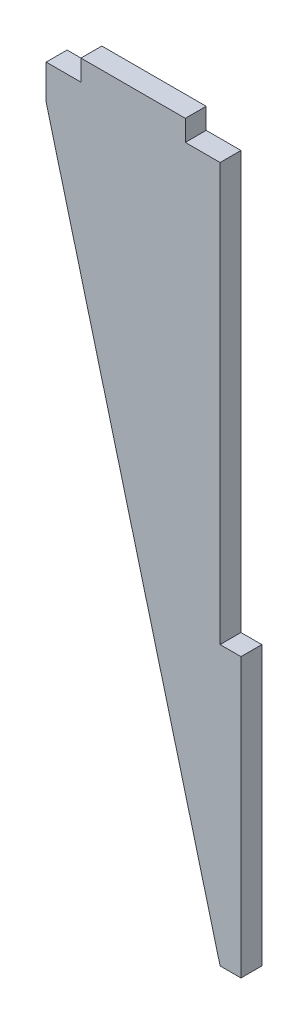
ISO-10303-21;
HEADER;
FILE_DESCRIPTION(('STEP AP214'),'2;1');
FILE_NAME('part.step','',(''),(''),'','','');
FILE_SCHEMA(('AUTOMOTIVE_DESIGN { 1 0 10303 214 1 1 1 1 }'));
ENDSEC;
DATA;
#1=APPLICATION_CONTEXT('core data for automotive mechanical design processes');
#2=APPLICATION_PROTOCOL_DEFINITION('international standard','automotive_design',2000,#1);
#3=PRODUCT_CONTEXT('',#1,'mechanical');
#4=PRODUCT('Part','Part','',(#3));
#5=PRODUCT_RELATED_PRODUCT_CATEGORY('part','',(#4));
#6=PRODUCT_DEFINITION_FORMATION('','',#4);
#7=PRODUCT_DEFINITION_CONTEXT('part definition',#1,'design');
#8=PRODUCT_DEFINITION('design','',#6,#7);
#9=PRODUCT_DEFINITION_SHAPE('','',#8);
#10=(LENGTH_UNIT() NAMED_UNIT(*) SI_UNIT(.MILLI.,.METRE.));
#11=(NAMED_UNIT(*) PLANE_ANGLE_UNIT() SI_UNIT($,.RADIAN.));
#12=(NAMED_UNIT(*) SI_UNIT($,.STERADIAN.) SOLID_ANGLE_UNIT());
#13=UNCERTAINTY_MEASURE_WITH_UNIT(LENGTH_MEASURE(1.E-05),#10,'distance_accuracy_value','');
#14=(GEOMETRIC_REPRESENTATION_CONTEXT(3) GLOBAL_UNCERTAINTY_ASSIGNED_CONTEXT((#13)) GLOBAL_UNIT_ASSIGNED_CONTEXT((#10,
#11,#12)) REPRESENTATION_CONTEXT('',''));
#15=CARTESIAN_POINT('',(0.,0.,0.));
#16=DIRECTION('',(0.,0.,1.));
#17=DIRECTION('',(1.,0.,0.));
#18=AXIS2_PLACEMENT_3D('',#15,#16,#17);
#19=CARTESIAN_POINT('',(-95.0000000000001,-5.,109.737996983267));
#20=DIRECTION('',(0.967074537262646,0.254493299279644,0.));
#21=DIRECTION('',(-0.254493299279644,0.967074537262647,0.));
#22=AXIS2_PLACEMENT_3D('',#19,#20,#21);
#23=PLANE('',#22);
#24=DIRECTION('',(0.254493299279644,-0.967074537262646,0.));
#25=VECTOR('',#24,1.);
#26=CARTESIAN_POINT('',(-95.0000000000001,-5.,3.));
#27=LINE('',#26,#25);
#28=CARTESIAN_POINT('',(-95.0000000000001,-5.,3.));
#29=VERTEX_POINT('',#28);
#30=CARTESIAN_POINT('',(-70.,-100.,3.));
#31=VERTEX_POINT('',#30);
#32=EDGE_CURVE('E159',#29,#31,#27,.T.);
#33=ORIENTED_EDGE('',*,*,#32,.F.);
#34=DIRECTION('',(0.,0.,-1.));
#35=VECTOR('',#34,1.);
#36=CARTESIAN_POINT('',(-95.0000000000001,-5.,109.737996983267));
#37=LINE('',#36,#35);
#38=CARTESIAN_POINT('',(-95.0000000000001,-5.,0.));
#39=VERTEX_POINT('',#38);
#40=EDGE_CURVE('E37',#29,#39,#37,.T.);
#41=ORIENTED_EDGE('',*,*,#40,.T.);
#42=DIRECTION('',(0.254493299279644,-0.967074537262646,0.));
#43=VECTOR('',#42,1.);
#44=CARTESIAN_POINT('',(-95.0000000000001,-5.,0.));
#45=LINE('',#44,#43);
#46=CARTESIAN_POINT('',(-70.,-100.,0.));
#47=VERTEX_POINT('',#46);
#48=EDGE_CURVE('E167',#39,#47,#45,.T.);
#49=ORIENTED_EDGE('',*,*,#48,.T.);
#50=DIRECTION('',(0.,0.,-1.));
#51=VECTOR('',#50,1.);
#52=CARTESIAN_POINT('',(-70.,-100.,109.737996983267));
#53=LINE('',#52,#51);
#54=EDGE_CURVE('E100',#31,#47,#53,.T.);
#55=ORIENTED_EDGE('',*,*,#54,.F.);
#56=EDGE_LOOP('',(#33,#41,#49,#55));
#57=FACE_BOUND('',#56,.T.);
#58=ADVANCED_FACE('F33',(#57),#23,.F.);
#59=CARTESIAN_POINT('',(-67.,-100.,109.737996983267));
#60=DIRECTION('',(0.,1.,0.));
#61=DIRECTION('',(0.,0.,1.));
#62=AXIS2_PLACEMENT_3D('',#59,#60,#61);
#63=PLANE('',#62);
#64=DIRECTION('',(1.,0.,0.));
#65=VECTOR('',#64,1.);
#66=CARTESIAN_POINT('',(-67.,-100.,3.));
#67=LINE('',#66,#65);
#68=CARTESIAN_POINT('',(-67.,-100.,3.));
#69=VERTEX_POINT('',#68);
#70=EDGE_CURVE('E107',#31,#69,#67,.T.);
#71=ORIENTED_EDGE('',*,*,#70,.F.);
#72=ORIENTED_EDGE('',*,*,#54,.T.);
#73=DIRECTION('',(1.,0.,0.));
#74=VECTOR('',#73,1.);
#75=CARTESIAN_POINT('',(-67.,-100.,0.));
#76=LINE('',#75,#74);
#77=CARTESIAN_POINT('',(-67.,-100.,0.));
#78=VERTEX_POINT('',#77);
#79=EDGE_CURVE('E166',#47,#78,#76,.T.);
#80=ORIENTED_EDGE('',*,*,#79,.T.);
#81=DIRECTION('',(0.,0.,-1.));
#82=VECTOR('',#81,1.);
#83=CARTESIAN_POINT('',(-67.,-100.,109.737996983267));
#84=LINE('',#83,#82);
#85=EDGE_CURVE('E168',#69,#78,#84,.T.);
#86=ORIENTED_EDGE('',*,*,#85,.F.);
#87=EDGE_LOOP('',(#71,#72,#80,#86));
#88=FACE_BOUND('',#87,.T.);
#89=ADVANCED_FACE('F212',(#88),#63,.F.);
#90=CARTESIAN_POINT('',(-67.,-60.,109.737996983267));
#91=DIRECTION('',(-1.,0.,0.));
#92=DIRECTION('',(0.,0.,1.));
#93=AXIS2_PLACEMENT_3D('',#90,#91,#92);
#94=PLANE('',#93);
#95=DIRECTION('',(0.,1.,0.));
#96=VECTOR('',#95,1.);
#97=CARTESIAN_POINT('',(-67.,-60.,3.));
#98=LINE('',#97,#96);
#99=CARTESIAN_POINT('',(-67.,-60.,3.));
#100=VERTEX_POINT('',#99);
#101=EDGE_CURVE('E155',#69,#100,#98,.T.);
#102=ORIENTED_EDGE('',*,*,#101,.F.);
#103=ORIENTED_EDGE('',*,*,#85,.T.);
#104=DIRECTION('',(0.,1.,0.));
#105=VECTOR('',#104,1.);
#106=CARTESIAN_POINT('',(-67.,-60.,0.));
#107=LINE('',#106,#105);
#108=CARTESIAN_POINT('',(-67.,-60.,0.));
#109=VERTEX_POINT('',#108);
#110=EDGE_CURVE('E170',#78,#109,#107,.T.);
#111=ORIENTED_EDGE('',*,*,#110,.T.);
#112=DIRECTION('',(0.,0.,-1.));
#113=VECTOR('',#112,1.);
#114=CARTESIAN_POINT('',(-67.,-60.,109.737996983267));
#115=LINE('',#114,#113);
#116=EDGE_CURVE('E171',#100,#109,#115,.T.);
#117=ORIENTED_EDGE('',*,*,#116,.F.);
#118=EDGE_LOOP('',(#102,#103,#111,#117));
#119=FACE_BOUND('',#118,.T.);
#120=ADVANCED_FACE('F215',(#119),#94,.F.);
#121=CARTESIAN_POINT('',(-67.,-60.,109.737996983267));
#122=DIRECTION('',(0.,-1.,0.));
#123=DIRECTION('',(0.,0.,-1.));
#124=AXIS2_PLACEMENT_3D('',#121,#122,#123);
#125=PLANE('',#124);
#126=DIRECTION('',(-1.,0.,0.));
#127=VECTOR('',#126,1.);
#128=CARTESIAN_POINT('',(-67.,-60.,3.));
#129=LINE('',#128,#127);
#130=CARTESIAN_POINT('',(-70.,-60.,3.));
#131=VERTEX_POINT('',#130);
#132=EDGE_CURVE('E152',#100,#131,#129,.T.);
#133=ORIENTED_EDGE('',*,*,#132,.F.);
#134=ORIENTED_EDGE('',*,*,#116,.T.);
#135=DIRECTION('',(-1.,0.,0.));
#136=VECTOR('',#135,1.);
#137=CARTESIAN_POINT('',(-67.,-60.,0.));
#138=LINE('',#137,#136);
#139=CARTESIAN_POINT('',(-70.,-60.,0.));
#140=VERTEX_POINT('',#139);
#141=EDGE_CURVE('E173',#109,#140,#138,.T.);
#142=ORIENTED_EDGE('',*,*,#141,.T.);
#143=DIRECTION('',(0.,0.,-1.));
#144=VECTOR('',#143,1.);
#145=CARTESIAN_POINT('',(-70.,-60.,109.737996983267));
#146=LINE('',#145,#144);
#147=EDGE_CURVE('E174',#131,#140,#146,.T.);
#148=ORIENTED_EDGE('',*,*,#147,.F.);
#149=EDGE_LOOP('',(#133,#134,#142,#148));
#150=FACE_BOUND('',#149,.T.);
#151=ADVANCED_FACE('F217',(#150),#125,.F.);
#152=CARTESIAN_POINT('',(-70.,-60.,109.737996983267));
#153=DIRECTION('',(-1.,0.,0.));
#154=DIRECTION('',(0.,0.,1.));
#155=AXIS2_PLACEMENT_3D('',#152,#153,#154);
#156=PLANE('',#155);
#157=DIRECTION('',(0.,1.,0.));
#158=VECTOR('',#157,1.);
#159=CARTESIAN_POINT('',(-70.,-60.,3.));
#160=LINE('',#159,#158);
#161=CARTESIAN_POINT('',(-70.,0.,3.));
#162=VERTEX_POINT('',#161);
#163=EDGE_CURVE('E149',#131,#162,#160,.T.);
#164=ORIENTED_EDGE('',*,*,#163,.F.);
#165=ORIENTED_EDGE('',*,*,#147,.T.);
#166=DIRECTION('',(0.,1.,0.));
#167=VECTOR('',#166,1.);
#168=CARTESIAN_POINT('',(-70.,-60.,0.));
#169=LINE('',#168,#167);
#170=CARTESIAN_POINT('',(-70.,0.,0.));
#171=VERTEX_POINT('',#170);
#172=EDGE_CURVE('E176',#140,#171,#169,.T.);
#173=ORIENTED_EDGE('',*,*,#172,.T.);
#174=DIRECTION('',(0.,0.,-1.));
#175=VECTOR('',#174,1.);
#176=CARTESIAN_POINT('',(-70.,0.,109.737996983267));
#177=LINE('',#176,#175);
#178=EDGE_CURVE('E177',#162,#171,#177,.T.);
#179=ORIENTED_EDGE('',*,*,#178,.F.);
#180=EDGE_LOOP('',(#164,#165,#173,#179));
#181=FACE_BOUND('',#180,.T.);
#182=ADVANCED_FACE('F221',(#181),#156,.F.);
#183=CARTESIAN_POINT('',(-70.,0.,109.737996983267));
#184=DIRECTION('',(0.,-1.,0.));
#185=DIRECTION('',(1.,0.,0.));
#186=AXIS2_PLACEMENT_3D('',#183,#184,#185);
#187=PLANE('',#186);
#188=DIRECTION('',(-1.,0.,0.));
#189=VECTOR('',#188,1.);
#190=CARTESIAN_POINT('',(-70.,0.,3.));
#191=LINE('',#190,#189);
#192=CARTESIAN_POINT('',(-75.0000000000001,0.,3.));
#193=VERTEX_POINT('',#192);
#194=EDGE_CURVE('E146',#162,#193,#191,.T.);
#195=ORIENTED_EDGE('',*,*,#194,.F.);
#196=ORIENTED_EDGE('',*,*,#178,.T.);
#197=DIRECTION('',(-1.,0.,0.));
#198=VECTOR('',#197,1.);
#199=CARTESIAN_POINT('',(-70.,0.,0.));
#200=LINE('',#199,#198);
#201=CARTESIAN_POINT('',(-75.0000000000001,0.,0.));
#202=VERTEX_POINT('',#201);
#203=EDGE_CURVE('E179',#171,#202,#200,.T.);
#204=ORIENTED_EDGE('',*,*,#203,.T.);
#205=DIRECTION('',(0.,0.,-1.));
#206=VECTOR('',#205,1.);
#207=CARTESIAN_POINT('',(-75.0000000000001,0.,109.737996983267));
#208=LINE('',#207,#206);
#209=EDGE_CURVE('E180',#193,#202,#208,.T.);
#210=ORIENTED_EDGE('',*,*,#209,.F.);
#211=EDGE_LOOP('',(#195,#196,#204,#210));
#212=FACE_BOUND('',#211,.T.);
#213=ADVANCED_FACE('F226',(#212),#187,.F.);
#214=CARTESIAN_POINT('',(-75.0000000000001,0.,109.737996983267));
#215=DIRECTION('',(-1.,0.,0.));
#216=DIRECTION('',(0.,0.,1.));
#217=AXIS2_PLACEMENT_3D('',#214,#215,#216);
#218=PLANE('',#217);
#219=DIRECTION('',(0.,1.,0.));
#220=VECTOR('',#219,1.);
#221=CARTESIAN_POINT('',(-75.0000000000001,0.,3.));
#222=LINE('',#221,#220);
#223=CARTESIAN_POINT('',(-75.0000000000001,3.,3.));
#224=VERTEX_POINT('',#223);
#225=EDGE_CURVE('E141',#193,#224,#222,.T.);
#226=ORIENTED_EDGE('',*,*,#225,.F.);
#227=ORIENTED_EDGE('',*,*,#209,.T.);
#228=DIRECTION('',(0.,1.,0.));
#229=VECTOR('',#228,1.);
#230=CARTESIAN_POINT('',(-75.0000000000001,0.,0.));
#231=LINE('',#230,#229);
#232=CARTESIAN_POINT('',(-75.0000000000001,3.,0.));
#233=VERTEX_POINT('',#232);
#234=EDGE_CURVE('E182',#202,#233,#231,.T.);
#235=ORIENTED_EDGE('',*,*,#234,.T.);
#236=DIRECTION('',(0.,0.,-1.));
#237=VECTOR('',#236,1.);
#238=CARTESIAN_POINT('',(-75.0000000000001,3.,109.737996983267));
#239=LINE('',#238,#237);
#240=EDGE_CURVE('E183',#224,#233,#239,.T.);
#241=ORIENTED_EDGE('',*,*,#240,.F.);
#242=EDGE_LOOP('',(#226,#227,#235,#241));
#243=FACE_BOUND('',#242,.T.);
#244=ADVANCED_FACE('F229',(#243),#218,.F.);
#245=CARTESIAN_POINT('',(-75.0000000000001,3.,109.737996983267));
#246=DIRECTION('',(0.,-1.,0.));
#247=DIRECTION('',(1.,0.,0.));
#248=AXIS2_PLACEMENT_3D('',#245,#246,#247);
#249=PLANE('',#248);
#250=DIRECTION('',(-1.,0.,0.));
#251=VECTOR('',#250,1.);
#252=CARTESIAN_POINT('',(-75.0000000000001,3.,3.));
#253=LINE('',#252,#251);
#254=CARTESIAN_POINT('',(-90.0000000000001,3.,3.));
#255=VERTEX_POINT('',#254);
#256=EDGE_CURVE('E139',#224,#255,#253,.T.);
#257=ORIENTED_EDGE('',*,*,#256,.F.);
#258=ORIENTED_EDGE('',*,*,#240,.T.);
#259=DIRECTION('',(-1.,0.,0.));
#260=VECTOR('',#259,1.);
#261=CARTESIAN_POINT('',(-75.0000000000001,3.,0.));
#262=LINE('',#261,#260);
#263=CARTESIAN_POINT('',(-90.0000000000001,3.,0.));
#264=VERTEX_POINT('',#263);
#265=EDGE_CURVE('E185',#233,#264,#262,.T.);
#266=ORIENTED_EDGE('',*,*,#265,.T.);
#267=DIRECTION('',(0.,0.,-1.));
#268=VECTOR('',#267,1.);
#269=CARTESIAN_POINT('',(-90.0000000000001,3.,109.737996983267));
#270=LINE('',#269,#268);
#271=EDGE_CURVE('E186',#255,#264,#270,.T.);
#272=ORIENTED_EDGE('',*,*,#271,.F.);
#273=EDGE_LOOP('',(#257,#258,#266,#272));
#274=FACE_BOUND('',#273,.T.);
#275=ADVANCED_FACE('F233',(#274),#249,.F.);
#276=CARTESIAN_POINT('',(-90.0000000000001,3.,109.737996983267));
#277=DIRECTION('',(1.,0.,0.));
#278=DIRECTION('',(0.,0.,-1.));
#279=AXIS2_PLACEMENT_3D('',#276,#277,#278);
#280=PLANE('',#279);
#281=DIRECTION('',(0.,-1.,0.));
#282=VECTOR('',#281,1.);
#283=CARTESIAN_POINT('',(-90.0000000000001,3.,3.));
#284=LINE('',#283,#282);
#285=CARTESIAN_POINT('',(-90.0000000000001,0.,3.));
#286=VERTEX_POINT('',#285);
#287=EDGE_CURVE('E42',#255,#286,#284,.T.);
#288=ORIENTED_EDGE('',*,*,#287,.F.);
#289=ORIENTED_EDGE('',*,*,#271,.T.);
#290=DIRECTION('',(0.,-1.,0.));
#291=VECTOR('',#290,1.);
#292=CARTESIAN_POINT('',(-90.0000000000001,3.,0.));
#293=LINE('',#292,#291);
#294=CARTESIAN_POINT('',(-90.0000000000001,0.,0.));
#295=VERTEX_POINT('',#294);
#296=EDGE_CURVE('E133',#264,#295,#293,.T.);
#297=ORIENTED_EDGE('',*,*,#296,.T.);
#298=DIRECTION('',(0.,0.,-1.));
#299=VECTOR('',#298,1.);
#300=CARTESIAN_POINT('',(-90.0000000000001,0.,109.737996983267));
#301=LINE('',#300,#299);
#302=EDGE_CURVE('E124',#286,#295,#301,.T.);
#303=ORIENTED_EDGE('',*,*,#302,.F.);
#304=EDGE_LOOP('',(#288,#289,#297,#303));
#305=FACE_BOUND('',#304,.T.);
#306=ADVANCED_FACE('F130',(#305),#280,.F.);
#307=CARTESIAN_POINT('',(-90.0000000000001,0.,109.737996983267));
#308=DIRECTION('',(0.,-1.,0.));
#309=DIRECTION('',(1.,0.,0.));
#310=AXIS2_PLACEMENT_3D('',#307,#308,#309);
#311=PLANE('',#310);
#312=DIRECTION('',(-1.,0.,0.));
#313=VECTOR('',#312,1.);
#314=CARTESIAN_POINT('',(-90.0000000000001,0.,3.));
#315=LINE('',#314,#313);
#316=CARTESIAN_POINT('',(-95.0000000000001,0.,3.));
#317=VERTEX_POINT('',#316);
#318=EDGE_CURVE('E11',#286,#317,#315,.T.);
#319=ORIENTED_EDGE('',*,*,#318,.F.);
#320=ORIENTED_EDGE('',*,*,#302,.T.);
#321=DIRECTION('',(-1.,0.,0.));
#322=VECTOR('',#321,1.);
#323=CARTESIAN_POINT('',(-90.0000000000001,0.,0.));
#324=LINE('',#323,#322);
#325=CARTESIAN_POINT('',(-95.0000000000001,0.,0.));
#326=VERTEX_POINT('',#325);
#327=EDGE_CURVE('E135',#295,#326,#324,.T.);
#328=ORIENTED_EDGE('',*,*,#327,.T.);
#329=DIRECTION('',(0.,0.,-1.));
#330=VECTOR('',#329,1.);
#331=CARTESIAN_POINT('',(-95.0000000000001,0.,109.737996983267));
#332=LINE('',#331,#330);
#333=EDGE_CURVE('E55',#317,#326,#332,.T.);
#334=ORIENTED_EDGE('',*,*,#333,.F.);
#335=EDGE_LOOP('',(#319,#320,#328,#334));
#336=FACE_BOUND('',#335,.T.);
#337=ADVANCED_FACE('F123',(#336),#311,.F.);
#338=CARTESIAN_POINT('',(-95.0000000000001,0.,109.737996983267));
#339=DIRECTION('',(1.,0.,0.));
#340=DIRECTION('',(0.,0.,-1.));
#341=AXIS2_PLACEMENT_3D('',#338,#339,#340);
#342=PLANE('',#341);
#343=DIRECTION('',(0.,-1.,0.));
#344=VECTOR('',#343,1.);
#345=CARTESIAN_POINT('',(-95.0000000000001,0.,3.));
#346=LINE('',#345,#344);
#347=EDGE_CURVE('E162',#317,#29,#346,.T.);
#348=ORIENTED_EDGE('',*,*,#347,.F.);
#349=ORIENTED_EDGE('',*,*,#333,.T.);
#350=DIRECTION('',(0.,-1.,0.));
#351=VECTOR('',#350,1.);
#352=CARTESIAN_POINT('',(-95.0000000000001,0.,0.));
#353=LINE('',#352,#351);
#354=EDGE_CURVE('E164',#326,#39,#353,.T.);
#355=ORIENTED_EDGE('',*,*,#354,.T.);
#356=ORIENTED_EDGE('',*,*,#40,.F.);
#357=EDGE_LOOP('',(#348,#349,#355,#356));
#358=FACE_BOUND('',#357,.T.);
#359=ADVANCED_FACE('F207',(#358),#342,.F.);
#360=CARTESIAN_POINT('',(0.,0.,0.));
#361=DIRECTION('',(0.,0.,-1.));
#362=DIRECTION('',(-1.,0.,0.));
#363=AXIS2_PLACEMENT_3D('',#360,#361,#362);
#364=PLANE('',#363);
#365=ORIENTED_EDGE('',*,*,#48,.F.);
#366=ORIENTED_EDGE('',*,*,#354,.F.);
#367=ORIENTED_EDGE('',*,*,#327,.F.);
#368=ORIENTED_EDGE('',*,*,#296,.F.);
#369=ORIENTED_EDGE('',*,*,#265,.F.);
#370=ORIENTED_EDGE('',*,*,#234,.F.);
#371=ORIENTED_EDGE('',*,*,#203,.F.);
#372=ORIENTED_EDGE('',*,*,#172,.F.);
#373=ORIENTED_EDGE('',*,*,#141,.F.);
#374=ORIENTED_EDGE('',*,*,#110,.F.);
#375=ORIENTED_EDGE('',*,*,#79,.F.);
#376=EDGE_LOOP('',(#365,#366,#367,#368,#369,#370,#371,#372,#373,#374,#375));
#377=FACE_BOUND('',#376,.T.);
#378=ADVANCED_FACE('F209',(#377),#364,.T.);
#379=CARTESIAN_POINT('',(-66.99995,-100.,3.));
#380=DIRECTION('',(0.,0.,1.));
#381=DIRECTION('',(0.,1.,0.));
#382=AXIS2_PLACEMENT_3D('',#379,#380,#381);
#383=PLANE('',#382);
#384=ORIENTED_EDGE('',*,*,#347,.T.);
#385=ORIENTED_EDGE('',*,*,#32,.T.);
#386=ORIENTED_EDGE('',*,*,#70,.T.);
#387=ORIENTED_EDGE('',*,*,#101,.T.);
#388=ORIENTED_EDGE('',*,*,#132,.T.);
#389=ORIENTED_EDGE('',*,*,#163,.T.);
#390=ORIENTED_EDGE('',*,*,#194,.T.);
#391=ORIENTED_EDGE('',*,*,#225,.T.);
#392=ORIENTED_EDGE('',*,*,#256,.T.);
#393=ORIENTED_EDGE('',*,*,#287,.T.);
#394=ORIENTED_EDGE('',*,*,#318,.T.);
#395=EDGE_LOOP('',(#384,#385,#386,#387,#388,#389,#390,#391,#392,#393,#394));
#396=FACE_BOUND('',#395,.T.);
#397=ADVANCED_FACE('F35',(#396),#383,.T.);
#398=CLOSED_SHELL('',(#58,#89,#120,#151,#182,#213,#244,#275,#306,#337,#359,#378,#397));
#399=MANIFOLD_SOLID_BREP('B2',#398);
#400=ADVANCED_BREP_SHAPE_REPRESENTATION('',(#18,#399),#14);
#401=SHAPE_DEFINITION_REPRESENTATION(#9,#400);
ENDSEC;
END-ISO-10303-21;
